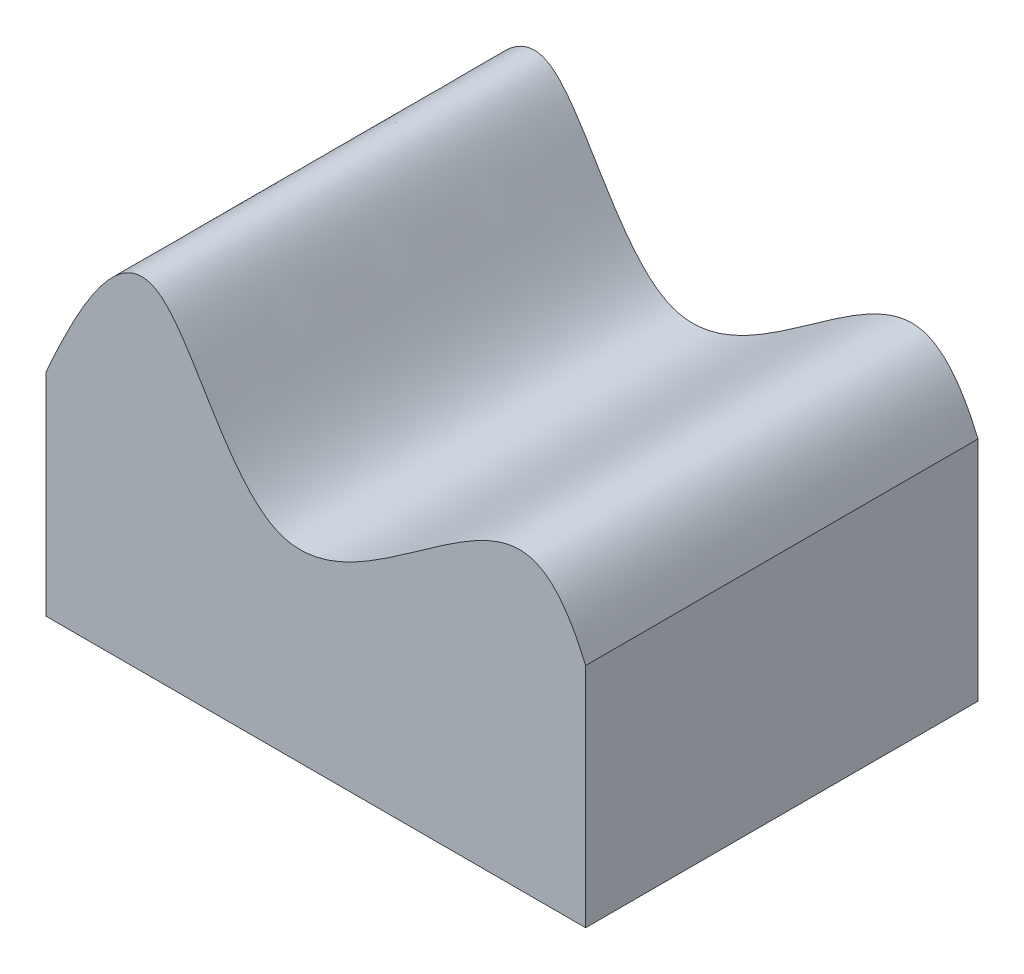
ISO-10303-21;
HEADER;
FILE_DESCRIPTION(('STEP AP214'),'2;1');
FILE_NAME('part.step','',(''),(''),'','','');
FILE_SCHEMA(('AUTOMOTIVE_DESIGN { 1 0 10303 214 1 1 1 1 }'));
ENDSEC;
DATA;
#1=APPLICATION_CONTEXT('core data for automotive mechanical design processes');
#2=APPLICATION_PROTOCOL_DEFINITION('international standard','automotive_design',2000,#1);
#3=PRODUCT_CONTEXT('',#1,'mechanical');
#4=PRODUCT('Part','Part','',(#3));
#5=PRODUCT_RELATED_PRODUCT_CATEGORY('part','',(#4));
#6=PRODUCT_DEFINITION_FORMATION('','',#4);
#7=PRODUCT_DEFINITION_CONTEXT('part definition',#1,'design');
#8=PRODUCT_DEFINITION('design','',#6,#7);
#9=PRODUCT_DEFINITION_SHAPE('','',#8);
#10=(LENGTH_UNIT() NAMED_UNIT(*) SI_UNIT(.MILLI.,.METRE.));
#11=(NAMED_UNIT(*) PLANE_ANGLE_UNIT() SI_UNIT($,.RADIAN.));
#12=(NAMED_UNIT(*) SI_UNIT($,.STERADIAN.) SOLID_ANGLE_UNIT());
#13=UNCERTAINTY_MEASURE_WITH_UNIT(LENGTH_MEASURE(1.E-05),#10,'distance_accuracy_value','');
#14=(GEOMETRIC_REPRESENTATION_CONTEXT(3) GLOBAL_UNCERTAINTY_ASSIGNED_CONTEXT((#13)) GLOBAL_UNIT_ASSIGNED_CONTEXT((#10,
#11,#12)) REPRESENTATION_CONTEXT('',''));
#15=CARTESIAN_POINT('',(0.,0.,0.));
#16=DIRECTION('',(0.,0.,1.));
#17=DIRECTION('',(1.,0.,0.));
#18=AXIS2_PLACEMENT_3D('',#15,#16,#17);
#19=CARTESIAN_POINT('',(-60.6854417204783,-29.9963508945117,44.1280693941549));
#20=DIRECTION('',(1.,0.,0.));
#21=DIRECTION('',(0.,0.,-1.));
#22=AXIS2_PLACEMENT_3D('',#19,#20,#21);
#23=PLANE('',#22);
#24=DIRECTION('',(0.,-1.,0.));
#25=VECTOR('',#24,1.);
#26=CARTESIAN_POINT('',(-60.6854417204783,-29.9963508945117,-44.1280693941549));
#27=LINE('',#26,#25);
#28=CARTESIAN_POINT('',(-60.6854417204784,17.5855673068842,-44.1280693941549));
#29=VERTEX_POINT('',#28);
#30=CARTESIAN_POINT('',(-60.6854417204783,-29.9963508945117,-44.1280693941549));
#31=VERTEX_POINT('',#30);
#32=EDGE_CURVE('E159',#29,#31,#27,.T.);
#33=ORIENTED_EDGE('',*,*,#32,.T.);
#34=DIRECTION('',(0.,0.,-1.));
#35=VECTOR('',#34,1.);
#36=CARTESIAN_POINT('',(-60.6854417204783,-29.9963508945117,44.1280693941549));
#37=LINE('',#36,#35);
#38=CARTESIAN_POINT('',(-60.6854417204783,-29.9963508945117,44.1280693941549));
#39=VERTEX_POINT('',#38);
#40=EDGE_CURVE('E44',#39,#31,#37,.T.);
#41=ORIENTED_EDGE('',*,*,#40,.F.);
#42=DIRECTION('',(0.,-1.,0.));
#43=VECTOR('',#42,1.);
#44=CARTESIAN_POINT('',(-60.6854417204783,-29.9963508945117,44.1280693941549));
#45=LINE('',#44,#43);
#46=CARTESIAN_POINT('',(-60.6854417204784,17.5855673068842,44.1280693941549));
#47=VERTEX_POINT('',#46);
#48=EDGE_CURVE('E153',#47,#39,#45,.T.);
#49=ORIENTED_EDGE('',*,*,#48,.F.);
#50=DIRECTION('',(0.,0.,1.));
#51=VECTOR('',#50,1.);
#52=CARTESIAN_POINT('',(-60.6854417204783,17.5855673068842,0.));
#53=LINE('',#52,#51);
#54=EDGE_CURVE('E106',#47,#29,#53,.F.);
#55=ORIENTED_EDGE('',*,*,#54,.T.);
#56=EDGE_LOOP('',(#33,#41,#49,#55));
#57=FACE_BOUND('',#56,.T.);
#58=ADVANCED_FACE('F100',(#57),#23,.F.);
#59=CARTESIAN_POINT('',(-60.6854417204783,-29.9963508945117,44.1280693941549));
#60=DIRECTION('',(0.,1.,0.));
#61=DIRECTION('',(0.,0.,1.));
#62=AXIS2_PLACEMENT_3D('',#59,#60,#61);
#63=PLANE('',#62);
#64=DIRECTION('',(1.,0.,0.));
#65=VECTOR('',#64,1.);
#66=CARTESIAN_POINT('',(-60.6854417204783,-29.9963508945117,-44.1280693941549));
#67=LINE('',#66,#65);
#68=CARTESIAN_POINT('',(60.6854417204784,-29.9963508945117,-44.1280693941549));
#69=VERTEX_POINT('',#68);
#70=EDGE_CURVE('E161',#31,#69,#67,.T.);
#71=ORIENTED_EDGE('',*,*,#70,.T.);
#72=DIRECTION('',(0.,0.,-1.));
#73=VECTOR('',#72,1.);
#74=CARTESIAN_POINT('',(60.6854417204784,-29.9963508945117,44.1280693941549));
#75=LINE('',#74,#73);
#76=CARTESIAN_POINT('',(60.6854417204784,-29.9963508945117,44.1280693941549));
#77=VERTEX_POINT('',#76);
#78=EDGE_CURVE('E112',#77,#69,#75,.T.);
#79=ORIENTED_EDGE('',*,*,#78,.F.);
#80=DIRECTION('',(1.,0.,0.));
#81=VECTOR('',#80,1.);
#82=CARTESIAN_POINT('',(-60.6854417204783,-29.9963508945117,44.1280693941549));
#83=LINE('',#82,#81);
#84=EDGE_CURVE('E140',#39,#77,#83,.T.);
#85=ORIENTED_EDGE('',*,*,#84,.F.);
#86=ORIENTED_EDGE('',*,*,#40,.T.);
#87=EDGE_LOOP('',(#71,#79,#85,#86));
#88=FACE_BOUND('',#87,.T.);
#89=ADVANCED_FACE('F188',(#88),#63,.F.);
#90=CARTESIAN_POINT('',(60.6854417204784,-29.9963508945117,44.1280693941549));
#91=DIRECTION('',(-1.,0.,0.));
#92=DIRECTION('',(0.,-1.,0.));
#93=AXIS2_PLACEMENT_3D('',#90,#91,#92);
#94=PLANE('',#93);
#95=DIRECTION('',(0.,1.,0.));
#96=VECTOR('',#95,1.);
#97=CARTESIAN_POINT('',(60.6854417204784,-29.9963508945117,-44.1280693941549));
#98=LINE('',#97,#96);
#99=CARTESIAN_POINT('',(60.6854417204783,21.0898986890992,-44.1280693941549));
#100=VERTEX_POINT('',#99);
#101=EDGE_CURVE('E154',#69,#100,#98,.T.);
#102=ORIENTED_EDGE('',*,*,#101,.T.);
#103=DIRECTION('',(0.,0.,1.));
#104=VECTOR('',#103,1.);
#105=CARTESIAN_POINT('',(60.6854417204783,21.0898986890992,0.));
#106=LINE('',#105,#104);
#107=CARTESIAN_POINT('',(60.6854417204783,21.0898986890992,44.1280693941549));
#108=VERTEX_POINT('',#107);
#109=EDGE_CURVE('E149',#108,#100,#106,.F.);
#110=ORIENTED_EDGE('',*,*,#109,.F.);
#111=DIRECTION('',(0.,1.,0.));
#112=VECTOR('',#111,1.);
#113=CARTESIAN_POINT('',(60.6854417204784,-29.9963508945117,44.1280693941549));
#114=LINE('',#113,#112);
#115=EDGE_CURVE('E165',#77,#108,#114,.T.);
#116=ORIENTED_EDGE('',*,*,#115,.F.);
#117=ORIENTED_EDGE('',*,*,#78,.T.);
#118=EDGE_LOOP('',(#102,#110,#116,#117));
#119=FACE_BOUND('',#118,.T.);
#120=ADVANCED_FACE('F185',(#119),#94,.F.);
#121=CARTESIAN_POINT('',(-69.1741102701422,-2.69924633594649,-70.5138398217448));
#122=CARTESIAN_POINT('',(-57.8502774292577,25.0636272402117,-70.5138398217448));
#123=CARTESIAN_POINT('',(-38.1766225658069,73.2979309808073,-70.5138398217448));
#124=CARTESIAN_POINT('',(-9.11600174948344,-16.2820314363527,-70.5138398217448));
#125=CARTESIAN_POINT('',(50.3210809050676,60.8549096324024,-70.5138398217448));
#126=CARTESIAN_POINT('',(63.1056676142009,16.022012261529,-70.5138398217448));
#127=CARTESIAN_POINT('',(68.6261598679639,-3.33721054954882,-70.5138398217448));
#128=B_SPLINE_CURVE_WITH_KNOTS('',3,(#121,#122,#123,#124,#125,#126,#127),.UNSPECIFIED.,.F.,.F.,
(4,1,1,1,4),(0.,0.28457012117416,0.494402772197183,0.781678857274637,1.),.UNSPECIFIED.);
#129=DIRECTION('',(0.,0.,1.));
#130=VECTOR('',#129,1.);
#131=SURFACE_OF_LINEAR_EXTRUSION('',#128,#130);
#132=CARTESIAN_POINT('',(60.6854417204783,21.0898986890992,-44.1280693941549));
#133=CARTESIAN_POINT('',(60.5244460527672,21.4695030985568,-44.1280693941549));
#134=CARTESIAN_POINT('',(60.3604852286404,21.8478678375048,-44.1280693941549));
#135=CARTESIAN_POINT('',(60.0254467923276,22.6026398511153,-44.1280693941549));
#136=CARTESIAN_POINT('',(59.8543513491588,22.9790392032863,-44.1280693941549));
#137=CARTESIAN_POINT('',(59.5044409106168,23.7289445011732,-44.1280693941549));
#138=CARTESIAN_POINT('',(59.3256144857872,24.1024451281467,-44.1280693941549));
#139=CARTESIAN_POINT('',(58.9595060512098,24.8455427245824,-44.1280693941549));
#140=CARTESIAN_POINT('',(58.7722194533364,25.2151374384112,-44.1280693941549));
#141=CARTESIAN_POINT('',(58.384620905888,25.9564427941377,-44.1280693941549));
#142=CARTESIAN_POINT('',(58.1841287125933,26.3280594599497,-44.1280693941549));
#143=CARTESIAN_POINT('',(57.7723297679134,27.0649642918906,-44.1280693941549));
#144=CARTESIAN_POINT('',(57.5610299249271,27.4302563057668,-44.1280693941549));
#145=CARTESIAN_POINT('',(57.1262681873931,28.1531784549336,-44.1280693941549));
#146=CARTESIAN_POINT('',(56.9028155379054,28.5108141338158,-44.1280693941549));
#147=CARTESIAN_POINT('',(56.4420851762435,29.2169355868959,-44.1280693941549));
#148=CARTESIAN_POINT('',(56.2048126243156,29.565424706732,-44.1280693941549));
#149=CARTESIAN_POINT('',(55.8068960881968,30.1220654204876,-44.1280693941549));
#150=CARTESIAN_POINT('',(55.651042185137,30.3336468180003,-44.1280693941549));
#151=CARTESIAN_POINT('',(55.3327411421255,30.751830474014,-44.1280693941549));
#152=CARTESIAN_POINT('',(55.1702935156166,30.9584323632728,-44.1280693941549));
#153=CARTESIAN_POINT('',(54.8382993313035,31.3659069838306,-44.1280693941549));
#154=CARTESIAN_POINT('',(54.6687518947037,31.566779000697,-44.1280693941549));
#155=CARTESIAN_POINT('',(54.3225433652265,31.9613274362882,-44.1280693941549));
#156=CARTESIAN_POINT('',(54.1459033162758,32.1550222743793,-44.1280693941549));
#157=CARTESIAN_POINT('',(53.7845729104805,32.5347537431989,-44.1280693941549));
#158=CARTESIAN_POINT('',(53.5998830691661,32.7207908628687,-44.1280693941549));
#159=CARTESIAN_POINT('',(53.2219939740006,33.0839832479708,-44.1280693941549));
#160=CARTESIAN_POINT('',(53.0287957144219,33.2611395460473,-44.1280693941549));
#161=CARTESIAN_POINT('',(52.5861191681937,33.6464011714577,-44.1280693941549));
#162=CARTESIAN_POINT('',(52.3342370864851,33.8517669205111,-44.1280693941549));
#163=CARTESIAN_POINT('',(51.8162511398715,34.2436900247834,-44.1280693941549));
#164=CARTESIAN_POINT('',(51.5501502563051,34.4302512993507,-44.1280693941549));
#165=CARTESIAN_POINT('',(51.0040042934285,34.7809841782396,-44.1280693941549));
#166=CARTESIAN_POINT('',(50.7239785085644,34.9451856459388,-44.1280693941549));
#167=CARTESIAN_POINT('',(50.1503541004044,35.2479314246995,-44.1280693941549));
#168=CARTESIAN_POINT('',(49.8567583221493,35.3864810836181,-44.1280693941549));
#169=CARTESIAN_POINT('',(49.3046750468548,35.6151282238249,-44.1280693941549));
#170=CARTESIAN_POINT('',(49.0479228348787,35.7094184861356,-44.1280693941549));
#171=CARTESIAN_POINT('',(48.5273513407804,35.8758539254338,-44.1280693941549));
#172=CARTESIAN_POINT('',(48.2635329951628,35.9480020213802,-44.1280693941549));
#173=CARTESIAN_POINT('',(47.7308143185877,36.0690689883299,-44.1280693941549));
#174=CARTESIAN_POINT('',(47.4619184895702,36.118007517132,-44.1280693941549));
#175=CARTESIAN_POINT('',(47.0562277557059,36.1738294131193,-44.1280693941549));
#176=CARTESIAN_POINT('',(46.9205884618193,36.1895066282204,-44.1280693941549));
#177=CARTESIAN_POINT('',(46.6487592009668,36.215022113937,-44.1280693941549));
#178=CARTESIAN_POINT('',(46.5125692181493,36.2248602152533,-44.1280693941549));
#179=CARTESIAN_POINT('',(46.0311081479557,36.2496060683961,-44.1280693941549));
#180=CARTESIAN_POINT('',(45.6849670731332,36.2492142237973,-44.1280693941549));
#181=CARTESIAN_POINT('',(44.9942102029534,36.2169202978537,-44.1280693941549));
#182=CARTESIAN_POINT('',(44.6495953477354,36.1850009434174,-44.1280693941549));
#183=CARTESIAN_POINT('',(43.9626485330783,36.0942300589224,-44.1280693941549));
#184=CARTESIAN_POINT('',(43.620330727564,36.0352739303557,-44.1280693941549));
#185=CARTESIAN_POINT('',(42.9405391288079,35.8947701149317,-44.1280693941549));
#186=CARTESIAN_POINT('',(42.6030643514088,35.813227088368,-44.1280693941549));
#187=CARTESIAN_POINT('',(41.8305153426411,35.60335962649,-44.1280693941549));
#188=CARTESIAN_POINT('',(41.3972662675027,35.4683580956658,-44.1280693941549));
#189=CARTESIAN_POINT('',(40.5392181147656,35.1727218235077,-44.1280693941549));
#190=CARTESIAN_POINT('',(40.114428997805,35.012058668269,-44.1280693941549));
#191=CARTESIAN_POINT('',(39.2726066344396,34.670116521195,-44.1280693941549));
#192=CARTESIAN_POINT('',(38.8555850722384,34.4888089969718,-44.1280693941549));
#193=CARTESIAN_POINT('',(38.029044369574,34.1097161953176,-44.1280693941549));
#194=CARTESIAN_POINT('',(37.6195268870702,33.9119273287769,-44.1280693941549));
#195=CARTESIAN_POINT('',(36.8049787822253,33.501867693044,-44.1280693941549));
#196=CARTESIAN_POINT('',(36.399985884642,33.289522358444,-44.1280693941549));
#197=CARTESIAN_POINT('',(35.5964319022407,32.8540601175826,-44.1280693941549));
#198=CARTESIAN_POINT('',(35.1978642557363,32.6309552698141,-44.1280693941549));
#199=CARTESIAN_POINT('',(34.406126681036,32.1758487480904,-44.1280693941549));
#200=CARTESIAN_POINT('',(34.0129541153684,31.9438516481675,-44.1280693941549));
#201=CARTESIAN_POINT('',(33.2311709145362,31.4725014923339,-44.1280693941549));
#202=CARTESIAN_POINT('',(32.8425593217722,31.2331500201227,-44.1280693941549));
#203=CARTESIAN_POINT('',(31.8796003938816,30.6295635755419,-44.1280693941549));
#204=CARTESIAN_POINT('',(31.307579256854,30.2616214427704,-44.1280693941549));
#205=CARTESIAN_POINT('',(30.1700515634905,29.5157823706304,-44.1280693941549));
#206=CARTESIAN_POINT('',(29.6045453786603,29.1378848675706,-44.1280693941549));
#207=CARTESIAN_POINT('',(28.478033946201,28.3747287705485,-44.1280693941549));
#208=CARTESIAN_POINT('',(27.9170316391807,27.9894658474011,-44.1280693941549));
#209=CARTESIAN_POINT('',(26.7983617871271,27.2141662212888,-44.1280693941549));
#210=CARTESIAN_POINT('',(26.2406941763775,26.8241296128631,-44.1280693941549));
#211=CARTESIAN_POINT('',(25.1269750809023,26.0410988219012,-44.1280693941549));
#212=CARTESIAN_POINT('',(24.5709246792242,25.6481031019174,-44.1280693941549));
#213=CARTESIAN_POINT('',(23.4594483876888,24.8612327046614,-44.1280693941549));
#214=CARTESIAN_POINT('',(22.9040224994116,24.4673580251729,-44.1280693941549));
#215=CARTESIAN_POINT('',(21.2426744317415,23.2911894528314,-44.1280693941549));
#216=CARTESIAN_POINT('',(20.1358263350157,22.5101779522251,-44.1280693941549));
#217=CARTESIAN_POINT('',(18.4667567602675,21.3519008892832,-44.1280693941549));
#218=CARTESIAN_POINT('',(17.9090778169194,20.9681117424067,-44.1280693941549));
#219=CARTESIAN_POINT('',(16.7894688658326,20.2067934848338,-44.1280693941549));
#220=CARTESIAN_POINT('',(16.2275389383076,19.8292642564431,-44.1280693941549));
#221=CARTESIAN_POINT('',(15.098356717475,19.082716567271,-44.1280693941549));
#222=CARTESIAN_POINT('',(14.5311066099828,18.7136948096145,-44.1280693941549));
#223=CARTESIAN_POINT('',(13.389736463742,17.9864556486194,-44.1280693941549));
#224=CARTESIAN_POINT('',(12.8156167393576,17.6282377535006,-44.1280693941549));
#225=CARTESIAN_POINT('',(11.6608604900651,16.9265757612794,-44.1280693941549));
#226=CARTESIAN_POINT('',(11.0802501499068,16.5830887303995,-44.1280693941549));
#227=CARTESIAN_POINT('',(9.90915324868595,15.9131280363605,-44.1280693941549));
#228=CARTESIAN_POINT('',(9.31866549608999,15.5866564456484,-44.1280693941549));
#229=CARTESIAN_POINT('',(8.12398895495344,14.9538800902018,-44.1280693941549));
#230=CARTESIAN_POINT('',(7.51975590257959,14.6476584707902,-44.1280693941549));
#231=CARTESIAN_POINT('',(6.29820199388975,14.0623264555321,-44.1280693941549));
#232=CARTESIAN_POINT('',(5.68088195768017,13.7832143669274,-44.1280693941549));
#233=CARTESIAN_POINT('',(4.63398030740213,13.3441524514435,-44.1280693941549));
#234=CARTESIAN_POINT('',(4.208313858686,13.1748762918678,-44.1280693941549));
#235=CARTESIAN_POINT('',(3.34999453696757,12.8548131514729,-44.1280693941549));
#236=CARTESIAN_POINT('',(2.91734109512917,12.7040276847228,-44.1280693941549));
#237=CARTESIAN_POINT('',(2.04473278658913,12.4241798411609,-44.1280693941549));
#238=CARTESIAN_POINT('',(1.60477385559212,12.2951300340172,-44.1280693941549));
#239=CARTESIAN_POINT('',(0.720138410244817,12.0633168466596,-44.1280693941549));
#240=CARTESIAN_POINT('',(0.275494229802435,11.9604315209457,-44.1280693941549));
#241=CARTESIAN_POINT('',(-0.619564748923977,11.7846419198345,-44.1280693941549));
#242=CARTESIAN_POINT('',(-1.06997684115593,11.7117240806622,-44.1280693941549));
#243=CARTESIAN_POINT('',(-1.97473196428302,11.6008149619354,-44.1280693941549));
#244=CARTESIAN_POINT('',(-2.42907016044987,11.5627855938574,-44.1280693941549));
#245=CARTESIAN_POINT('',(-3.26119582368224,11.5297528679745,-44.1280693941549));
#246=CARTESIAN_POINT('',(-3.63872797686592,11.5284812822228,-44.1280693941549));
#247=CARTESIAN_POINT('',(-4.39273398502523,11.5560443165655,-44.1280693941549));
#248=CARTESIAN_POINT('',(-4.7692079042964,11.5848770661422,-44.1280693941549));
#249=CARTESIAN_POINT('',(-5.51739961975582,11.6747846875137,-44.1280693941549));
#250=CARTESIAN_POINT('',(-5.88912734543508,11.7357742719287,-44.1280693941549));
#251=CARTESIAN_POINT('',(-6.44129673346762,11.852332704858,-44.1280693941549));
#252=CARTESIAN_POINT('',(-6.6244556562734,11.8953664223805,-44.1280693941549));
#253=CARTESIAN_POINT('',(-6.98860271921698,11.9898480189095,-44.1280693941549));
#254=CARTESIAN_POINT('',(-7.16959089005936,12.0412957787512,-44.1280693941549));
#255=CARTESIAN_POINT('',(-7.52907673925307,12.1526180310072,-44.1280693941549));
#256=CARTESIAN_POINT('',(-7.70757282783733,12.21249765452,-44.1280693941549));
#257=CARTESIAN_POINT('',(-8.06155269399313,12.3405757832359,-44.1280693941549));
#258=CARTESIAN_POINT('',(-8.23703646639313,12.4087743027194,-44.1280693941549));
#259=CARTESIAN_POINT('',(-8.58479668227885,12.5529647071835,-44.1280693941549));
#260=CARTESIAN_POINT('',(-8.75707264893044,12.6289577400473,-44.1280693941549));
#261=CARTESIAN_POINT('',(-9.09824883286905,12.7881517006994,-44.1280693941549));
#262=CARTESIAN_POINT('',(-9.26714898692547,12.8713527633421,-44.1280693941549));
#263=CARTESIAN_POINT('',(-9.7696736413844,13.1314561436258,-44.1280693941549));
#264=CARTESIAN_POINT('',(-10.098124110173,13.3184389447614,-44.1280693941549));
#265=CARTESIAN_POINT('',(-10.7410288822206,13.7148857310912,-44.1280693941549));
#266=CARTESIAN_POINT('',(-11.0554820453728,13.9243515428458,-44.1280693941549));
#267=CARTESIAN_POINT('',(-11.734408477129,14.4071677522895,-44.1280693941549));
#268=CARTESIAN_POINT('',(-12.0958379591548,14.6847884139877,-44.1280693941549));
#269=CARTESIAN_POINT('',(-12.8008922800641,15.2620818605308,-44.1280693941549));
#270=CARTESIAN_POINT('',(-13.1445043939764,15.5617700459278,-44.1280693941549));
#271=CARTESIAN_POINT('',(-13.8155688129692,16.1788553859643,-44.1280693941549));
#272=CARTESIAN_POINT('',(-14.1430155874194,16.4962585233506,-44.1280693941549));
#273=CARTESIAN_POINT('',(-14.7841498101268,17.1460497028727,-44.1280693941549));
#274=CARTESIAN_POINT('',(-15.0978036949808,17.4784706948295,-44.1280693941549));
#275=CARTESIAN_POINT('',(-15.7121090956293,18.1547857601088,-44.1280693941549));
#276=CARTESIAN_POINT('',(-16.0127666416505,18.4986743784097,-44.1280693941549));
#277=CARTESIAN_POINT('',(-16.6027521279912,19.1959115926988,-44.1280693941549));
#278=CARTESIAN_POINT('',(-16.8920818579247,19.5492586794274,-44.1280693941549));
#279=CARTESIAN_POINT('',(-17.4281844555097,20.2227209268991,-44.1280693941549));
#280=CARTESIAN_POINT('',(-17.6760265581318,20.5419879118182,-44.1280693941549));
#281=CARTESIAN_POINT('',(-18.16487091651,21.1857237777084,-44.1280693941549));
#282=CARTESIAN_POINT('',(-18.4058729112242,21.5101928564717,-44.1280693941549));
#283=CARTESIAN_POINT('',(-19.1200437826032,22.4904377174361,-44.1280693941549));
#284=CARTESIAN_POINT('',(-19.5841787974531,23.1527984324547,-44.1280693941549));
#285=CARTESIAN_POINT('',(-20.4943411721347,24.4903982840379,-44.1280693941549));
#286=CARTESIAN_POINT('',(-20.9403559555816,25.165645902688,-44.1280693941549));
#287=CARTESIAN_POINT('',(-21.818971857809,26.52493816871,-44.1280693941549));
#288=CARTESIAN_POINT('',(-22.2515707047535,27.2089842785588,-44.1280693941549));
#289=CARTESIAN_POINT('',(-23.1086601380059,28.5840936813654,-44.1280693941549));
#290=CARTESIAN_POINT('',(-23.533131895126,29.2751686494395,-44.1280693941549));
#291=CARTESIAN_POINT('',(-24.3771636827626,30.6598030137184,-44.1280693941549));
#292=CARTESIAN_POINT('',(-24.7967261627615,31.3533609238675,-44.1280693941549));
#293=CARTESIAN_POINT('',(-25.635462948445,32.7403574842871,-44.1280693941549));
#294=CARTESIAN_POINT('',(-26.0546373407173,33.4337960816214,-44.1280693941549));
#295=CARTESIAN_POINT('',(-26.6869141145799,34.4717121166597,-44.1280693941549));
#296=CARTESIAN_POINT('',(-26.8982351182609,34.8172720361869,-44.1280693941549));
#297=CARTESIAN_POINT('',(-27.3227799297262,35.5072199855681,-44.1280693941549));
#298=CARTESIAN_POINT('',(-27.536003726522,35.8516080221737,-44.1280693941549));
#299=CARTESIAN_POINT('',(-27.9650405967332,36.538541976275,-44.1280693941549));
#300=CARTESIAN_POINT('',(-28.1808523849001,36.8810886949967,-44.1280693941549));
#301=CARTESIAN_POINT('',(-28.6161089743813,37.5639612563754,-44.1280693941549));
#302=CARTESIAN_POINT('',(-28.8355544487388,37.9042866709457,-44.1280693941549));
#303=CARTESIAN_POINT('',(-29.2791923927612,38.5820562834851,-44.1280693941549));
#304=CARTESIAN_POINT('',(-29.5033869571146,38.9194991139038,-44.1280693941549));
#305=CARTESIAN_POINT('',(-29.9578811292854,39.5906852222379,-44.1280693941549));
#306=CARTESIAN_POINT('',(-30.1881858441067,39.9244250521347,-44.1280693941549));
#307=CARTESIAN_POINT('',(-30.6555282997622,40.5856355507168,-44.1280693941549));
#308=CARTESIAN_POINT('',(-30.8925430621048,40.9131223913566,-44.1280693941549));
#309=CARTESIAN_POINT('',(-31.3758215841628,41.5611180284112,-44.1280693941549));
#310=CARTESIAN_POINT('',(-31.6220833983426,41.8816282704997,-44.1280693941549));
#311=CARTESIAN_POINT('',(-32.1260303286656,42.5130512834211,-44.1280693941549));
#312=CARTESIAN_POINT('',(-32.3837024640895,42.8239743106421,-44.1280693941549));
#313=CARTESIAN_POINT('',(-32.7811552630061,43.2806250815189,-44.1280693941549));
#314=CARTESIAN_POINT('',(-32.9154112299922,43.4311650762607,-44.1280693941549));
#315=CARTESIAN_POINT('',(-33.1880803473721,43.7284268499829,-44.1280693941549));
#316=CARTESIAN_POINT('',(-33.3264932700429,43.8751488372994,-44.1280693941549));
#317=CARTESIAN_POINT('',(-33.6508477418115,44.2080103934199,-44.1280693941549));
#318=CARTESIAN_POINT('',(-33.8384340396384,44.3925566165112,-44.1280693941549));
#319=CARTESIAN_POINT('',(-34.2230005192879,44.7518147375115,-44.1280693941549));
#320=CARTESIAN_POINT('',(-34.4199834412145,44.9265237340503,-44.1280693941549));
#321=CARTESIAN_POINT('',(-34.7232959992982,45.1786207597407,-44.1280693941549));
#322=CARTESIAN_POINT('',(-34.8255745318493,45.2608958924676,-44.1280693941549));
#323=CARTESIAN_POINT('',(-35.0330200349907,45.4217211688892,-44.1280693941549));
#324=CARTESIAN_POINT('',(-35.138186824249,45.5002715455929,-44.1280693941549));
#325=CARTESIAN_POINT('',(-35.3515333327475,45.6530437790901,-44.1280693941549));
#326=CARTESIAN_POINT('',(-35.4597111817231,45.7272682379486,-44.1280693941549));
#327=CARTESIAN_POINT('',(-35.6793411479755,45.8707641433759,-44.1280693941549));
#328=CARTESIAN_POINT('',(-35.7907939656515,45.9400345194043,-44.1280693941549));
#329=CARTESIAN_POINT('',(-36.0588081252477,46.0976179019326,-44.1280693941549));
#330=CARTESIAN_POINT('',(-36.2168118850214,46.1835023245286,-44.1280693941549));
#331=CARTESIAN_POINT('',(-36.5387415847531,46.34334212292,-44.1280693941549));
#332=CARTESIAN_POINT('',(-36.7026667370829,46.4172990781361,-44.1280693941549));
#333=CARTESIAN_POINT('',(-37.0358687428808,46.5517179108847,-44.1280693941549));
#334=CARTESIAN_POINT('',(-37.2051419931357,46.6121886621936,-44.1280693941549));
#335=CARTESIAN_POINT('',(-37.5483014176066,46.7182762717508,-44.1280693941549));
#336=CARTESIAN_POINT('',(-37.7221874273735,46.7638936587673,-44.1280693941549));
#337=CARTESIAN_POINT('',(-38.0746889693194,46.8394227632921,-44.1280693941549));
#338=CARTESIAN_POINT('',(-38.2533297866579,46.8692172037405,-44.1280693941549));
#339=CARTESIAN_POINT('',(-38.612620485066,46.9119085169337,-44.1280693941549));
#340=CARTESIAN_POINT('',(-38.7932703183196,46.9248057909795,-44.1280693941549));
#341=CARTESIAN_POINT('',(-39.1550483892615,46.9336158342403,-44.1280693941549));
#342=CARTESIAN_POINT('',(-39.3361767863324,46.9295219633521,-44.1280693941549));
#343=CARTESIAN_POINT('',(-39.6972974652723,46.9048490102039,-44.1280693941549));
#344=CARTESIAN_POINT('',(-39.8772896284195,46.8842682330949,-44.1280693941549));
#345=CARTESIAN_POINT('',(-40.2575833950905,46.8240075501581,-44.1280693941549));
#346=CARTESIAN_POINT('',(-40.4575525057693,46.782229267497,-44.1280693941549));
#347=CARTESIAN_POINT('',(-40.8528771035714,46.6809368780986,-44.1280693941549));
#348=CARTESIAN_POINT('',(-41.0482318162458,46.6214198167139,-44.1280693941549));
#349=CARTESIAN_POINT('',(-41.6265309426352,46.4192822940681,-44.1280693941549));
#350=CARTESIAN_POINT('',(-42.0014119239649,46.2531283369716,-44.1280693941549));
#351=CARTESIAN_POINT('',(-42.5153026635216,45.9849239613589,-44.1280693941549));
#352=CARTESIAN_POINT('',(-42.6647994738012,45.9017222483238,-44.1280693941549));
#353=CARTESIAN_POINT('',(-42.9596110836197,45.7282064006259,-44.1280693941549));
#354=CARTESIAN_POINT('',(-43.1049267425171,45.6378937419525,-44.1280693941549));
#355=CARTESIAN_POINT('',(-43.5349657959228,45.3575165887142,-44.1280693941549));
#356=CARTESIAN_POINT('',(-43.8136042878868,45.158107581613,-44.1280693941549));
#357=CARTESIAN_POINT('',(-44.3567712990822,44.7396507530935,-44.1280693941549));
#358=CARTESIAN_POINT('',(-44.6212574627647,44.5205487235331,-44.1280693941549));
#359=CARTESIAN_POINT('',(-45.1369005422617,44.0674514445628,-44.1280693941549));
#360=CARTESIAN_POINT('',(-45.3880620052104,43.8334613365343,-44.1280693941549));
#361=CARTESIAN_POINT('',(-45.9425542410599,43.2912477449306,-44.1280693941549));
#362=CARTESIAN_POINT('',(-46.2424673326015,42.9795432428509,-44.1280693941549));
#363=CARTESIAN_POINT('',(-46.8267918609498,42.3415877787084,-44.1280693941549));
#364=CARTESIAN_POINT('',(-47.1111907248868,42.0153253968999,-44.1280693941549));
#365=CARTESIAN_POINT('',(-47.6669122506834,41.351142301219,-44.1280693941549));
#366=CARTESIAN_POINT('',(-47.9382165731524,41.0132063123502,-44.1280693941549));
#367=CARTESIAN_POINT('',(-48.4694660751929,40.3280534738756,-44.1280693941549));
#368=CARTESIAN_POINT('',(-48.7294004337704,39.9808282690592,-44.1280693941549));
#369=CARTESIAN_POINT('',(-49.2391705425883,39.2791085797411,-44.1280693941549));
#370=CARTESIAN_POINT('',(-49.4890071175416,38.924614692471,-44.1280693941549));
#371=CARTESIAN_POINT('',(-49.9818716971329,38.2067012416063,-44.1280693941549));
#372=CARTESIAN_POINT('',(-50.224828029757,37.8432326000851,-44.1280693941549));
#373=CARTESIAN_POINT('',(-50.702624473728,37.1115708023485,-44.1280693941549));
#374=CARTESIAN_POINT('',(-50.9374730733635,36.7433831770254,-44.1280693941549));
#375=CARTESIAN_POINT('',(-51.4000935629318,36.0029076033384,-44.1280693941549));
#376=CARTESIAN_POINT('',(-51.6278696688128,35.6306222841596,-44.1280693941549));
#377=CARTESIAN_POINT('',(-52.07719396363,34.8824601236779,-44.1280693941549));
#378=CARTESIAN_POINT('',(-52.2987438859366,34.5065843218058,-44.1280693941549));
#379=CARTESIAN_POINT('',(-52.7363196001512,33.7516623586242,-44.1280693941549));
#380=CARTESIAN_POINT('',(-52.9523456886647,33.3726163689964,-44.1280693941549));
#381=CARTESIAN_POINT('',(-53.4022377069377,32.5711424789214,-44.1280693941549));
#382=CARTESIAN_POINT('',(-53.6355468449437,32.1484022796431,-44.1280693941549));
#383=CARTESIAN_POINT('',(-54.0967885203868,31.2999091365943,-44.1280693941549));
#384=CARTESIAN_POINT('',(-54.3247201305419,30.874155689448,-44.1280693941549));
#385=CARTESIAN_POINT('',(-54.7757728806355,30.0199948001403,-44.1280693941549));
#386=CARTESIAN_POINT('',(-54.9988929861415,29.5915868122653,-44.1280693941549));
#387=CARTESIAN_POINT('',(-55.4408045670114,28.7324334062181,-44.1280693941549));
#388=CARTESIAN_POINT('',(-55.6595951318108,28.3016875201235,-44.1280693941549));
#389=CARTESIAN_POINT('',(-56.0932618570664,27.4381400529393,-44.1280693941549));
#390=CARTESIAN_POINT('',(-56.3081373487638,27.0053381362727,-44.1280693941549));
#391=CARTESIAN_POINT('',(-56.7343333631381,26.1379322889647,-44.1280693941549));
#392=CARTESIAN_POINT('',(-56.9456535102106,25.7033281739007,-44.1280693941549));
#393=CARTESIAN_POINT('',(-57.3593001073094,24.8444931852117,-44.1280693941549));
#394=CARTESIAN_POINT('',(-57.5617143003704,24.4203045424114,-44.1280693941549));
#395=CARTESIAN_POINT('',(-57.9637322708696,23.5706361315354,-44.1280693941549));
#396=CARTESIAN_POINT('',(-58.1633362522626,23.1451564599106,-44.1280693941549));
#397=CARTESIAN_POINT('',(-58.5599580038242,22.2930931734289,-44.1280693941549));
#398=CARTESIAN_POINT('',(-58.7569762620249,21.8665097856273,-44.1280693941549));
#399=CARTESIAN_POINT('',(-59.1486263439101,21.012414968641,-44.1280693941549));
#400=CARTESIAN_POINT('',(-59.3432589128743,20.5849038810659,-44.1280693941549));
#401=CARTESIAN_POINT('',(-59.7303178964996,19.7291208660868,-44.1280693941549));
#402=CARTESIAN_POINT('',(-59.922745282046,19.3008493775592,-44.1280693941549));
#403=CARTESIAN_POINT('',(-60.3055526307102,18.4437021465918,-44.1280693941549));
#404=CARTESIAN_POINT('',(-60.4959337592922,18.0148269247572,-44.1280693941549));
#405=CARTESIAN_POINT('',(-60.6854417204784,17.5855673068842,-44.1280693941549));
#406=B_SPLINE_CURVE_WITH_KNOTS('',3,(#132,#133,#134,#135,#136,#137,#138,#139,#140,#141,#142,
#143,#144,#145,#146,#147,#148,#149,#150,#151,#152,#153,#154,#155,#156,#157,#158,#159,#160,#161,
#162,#163,#164,#165,#166,#167,#168,#169,#170,#171,#172,#173,#174,#175,#176,#177,#178,#179,#180,
#181,#182,#183,#184,#185,#186,#187,#188,#189,#190,#191,#192,#193,#194,#195,#196,#197,#198,#199,
#200,#201,#202,#203,#204,#205,#206,#207,#208,#209,#210,#211,#212,#213,#214,#215,#216,#217,#218,
#219,#220,#221,#222,#223,#224,#225,#226,#227,#228,#229,#230,#231,#232,#233,#234,#235,#236,#237,
#238,#239,#240,#241,#242,#243,#244,#245,#246,#247,#248,#249,#250,#251,#252,#253,#254,#255,#256,
#257,#258,#259,#260,#261,#262,#263,#264,#265,#266,#267,#268,#269,#270,#271,#272,#273,#274,#275,
#276,#277,#278,#279,#280,#281,#282,#283,#284,#285,#286,#287,#288,#289,#290,#291,#292,#293,#294,
#295,#296,#297,#298,#299,#300,#301,#302,#303,#304,#305,#306,#307,#308,#309,#310,#311,#312,#313,
#314,#315,#316,#317,#318,#319,#320,#321,#322,#323,#324,#325,#326,#327,#328,#329,#330,#331,#332,
#333,#334,#335,#336,#337,#338,#339,#340,#341,#342,#343,#344,#345,#346,#347,#348,#349,#350,#351,
#352,#353,#354,#355,#356,#357,#358,#359,#360,#361,#362,#363,#364,#365,#366,#367,#368,#369,#370,
#371,#372,#373,#374,#375,#376,#377,#378,#379,#380,#381,#382,#383,#384,#385,#386,#387,#388,#389,
#390,#391,#392,#393,#394,#395,#396,#397,#398,#399,#400,#401,#402,#403,#404,#405),.UNSPECIFIED.,
.F.,.F.,(4,2,2,2,2,2,2,2,2,2,2,2,2,2,2,2,2,2,2,2,2,2,2,2,2,2,2,2,2,2,2,2,2,2,2,2,2,2,2,2,2,2,2,
2,2,2,2,2,2,2,2,2,2,2,2,2,2,2,2,2,2,2,2,2,2,2,2,2,2,2,2,2,2,2,2,2,2,2,2,2,2,2,2,2,2,2,2,2,2,2,2,
2,2,2,2,2,2,2,2,2,2,2,2,2,2,2,2,2,2,2,2,2,2,2,2,2,2,2,2,2,2,2,2,2,2,2,2,2,2,2,2,2,2,2,2,2,4),
(0.,1.23701320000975,2.47732883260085,3.71954543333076,4.96244399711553,6.22903614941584,
7.49482855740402,8.75967114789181,10.0240444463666,10.8122967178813,11.600607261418,
12.3890156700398,13.1752364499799,13.9614069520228,14.7474858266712,15.7216867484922,
16.6956841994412,17.6683677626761,18.6408483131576,19.4604716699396,20.2799869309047,
21.0988068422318,21.5083238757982,21.9178527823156,22.9543885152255,23.9914924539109,
25.0326429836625,26.0735788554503,27.4339065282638,28.7957510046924,30.1595010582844,
31.5235488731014,32.8951986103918,34.2653452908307,35.6347964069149,37.0039546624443,
39.0442184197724,41.0845979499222,43.1262160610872,45.1677938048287,47.2105176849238,
49.2532467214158,53.3171332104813,55.3480374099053,57.3789033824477,59.4089686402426,
61.4389413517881,63.462527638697,65.4863598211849,67.5180429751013,69.5495991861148,
70.9235190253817,72.2975512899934,73.6723754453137,75.040669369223,76.4083432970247,
77.7745223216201,78.906046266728,80.0374999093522,81.1659676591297,81.7302400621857,
82.2945044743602,82.8591137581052,83.4237240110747,83.9884175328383,84.5531216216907,
85.6857686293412,86.8185077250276,88.1846450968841,89.5517450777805,90.9193095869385,
92.2900360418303,93.6601195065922,95.029985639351,96.2424075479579,97.4548756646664,
99.880775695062,102.308331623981,104.736296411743,107.169334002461,109.601100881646,
112.031955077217,113.247110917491,114.46225974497,115.676828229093,116.891624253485,
118.106967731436,119.323361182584,120.535999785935,121.748384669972,122.959424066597,
123.564490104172,124.169523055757,124.958690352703,125.748089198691,126.141810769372,
126.53550767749,126.928965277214,127.322507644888,127.861553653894,128.400528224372,
128.939147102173,129.477746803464,130.020284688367,130.56280968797,131.105546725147,
131.648339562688,132.260252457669,132.872267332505,134.097194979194,134.610384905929,
135.123468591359,136.150235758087,137.179921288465,138.209253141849,139.506253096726,
140.804288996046,142.10409301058,143.405108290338,144.706017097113,146.017478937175,
147.327523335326,148.636771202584,149.945650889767,151.254460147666,152.70295961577,
154.151707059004,155.600762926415,157.050120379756,158.499723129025,159.949478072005,
161.359490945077,162.769400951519,164.179040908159,165.588228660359,166.99677010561,
168.404461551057),.UNSPECIFIED.);
#407=EDGE_CURVE('E145',#100,#29,#406,.T.);
#408=ORIENTED_EDGE('',*,*,#407,.T.);
#409=ORIENTED_EDGE('',*,*,#54,.F.);
#410=CARTESIAN_POINT('',(60.6854417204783,21.0898986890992,44.1280693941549));
#411=CARTESIAN_POINT('',(60.5244460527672,21.4695030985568,44.1280693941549));
#412=CARTESIAN_POINT('',(60.3604852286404,21.8478678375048,44.1280693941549));
#413=CARTESIAN_POINT('',(60.0254467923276,22.6026398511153,44.1280693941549));
#414=CARTESIAN_POINT('',(59.8543513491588,22.9790392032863,44.1280693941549));
#415=CARTESIAN_POINT('',(59.5044409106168,23.7289445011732,44.1280693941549));
#416=CARTESIAN_POINT('',(59.3256144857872,24.1024451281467,44.1280693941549));
#417=CARTESIAN_POINT('',(58.9595060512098,24.8455427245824,44.1280693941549));
#418=CARTESIAN_POINT('',(58.7722194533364,25.2151374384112,44.1280693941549));
#419=CARTESIAN_POINT('',(58.384620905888,25.9564427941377,44.1280693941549));
#420=CARTESIAN_POINT('',(58.1841287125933,26.3280594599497,44.1280693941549));
#421=CARTESIAN_POINT('',(57.7723297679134,27.0649642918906,44.1280693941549));
#422=CARTESIAN_POINT('',(57.5610299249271,27.4302563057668,44.1280693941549));
#423=CARTESIAN_POINT('',(57.1262681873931,28.1531784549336,44.1280693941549));
#424=CARTESIAN_POINT('',(56.9028155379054,28.5108141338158,44.1280693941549));
#425=CARTESIAN_POINT('',(56.4420851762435,29.2169355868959,44.1280693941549));
#426=CARTESIAN_POINT('',(56.2048126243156,29.565424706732,44.1280693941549));
#427=CARTESIAN_POINT('',(55.8068960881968,30.1220654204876,44.1280693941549));
#428=CARTESIAN_POINT('',(55.651042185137,30.3336468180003,44.1280693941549));
#429=CARTESIAN_POINT('',(55.3327411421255,30.751830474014,44.1280693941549));
#430=CARTESIAN_POINT('',(55.1702935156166,30.9584323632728,44.1280693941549));
#431=CARTESIAN_POINT('',(54.8382993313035,31.3659069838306,44.1280693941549));
#432=CARTESIAN_POINT('',(54.6687518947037,31.566779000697,44.1280693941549));
#433=CARTESIAN_POINT('',(54.3225433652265,31.9613274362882,44.1280693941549));
#434=CARTESIAN_POINT('',(54.1459033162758,32.1550222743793,44.1280693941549));
#435=CARTESIAN_POINT('',(53.7845729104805,32.5347537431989,44.1280693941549));
#436=CARTESIAN_POINT('',(53.5998830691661,32.7207908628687,44.1280693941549));
#437=CARTESIAN_POINT('',(53.2219939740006,33.0839832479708,44.1280693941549));
#438=CARTESIAN_POINT('',(53.0287957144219,33.2611395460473,44.1280693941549));
#439=CARTESIAN_POINT('',(52.5861191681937,33.6464011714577,44.1280693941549));
#440=CARTESIAN_POINT('',(52.3342370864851,33.8517669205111,44.1280693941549));
#441=CARTESIAN_POINT('',(51.8162511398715,34.2436900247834,44.1280693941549));
#442=CARTESIAN_POINT('',(51.5501502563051,34.4302512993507,44.1280693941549));
#443=CARTESIAN_POINT('',(51.0040042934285,34.7809841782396,44.1280693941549));
#444=CARTESIAN_POINT('',(50.7239785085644,34.9451856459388,44.1280693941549));
#445=CARTESIAN_POINT('',(50.1503541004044,35.2479314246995,44.1280693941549));
#446=CARTESIAN_POINT('',(49.8567583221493,35.3864810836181,44.1280693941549));
#447=CARTESIAN_POINT('',(49.3046750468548,35.6151282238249,44.1280693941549));
#448=CARTESIAN_POINT('',(49.0479228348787,35.7094184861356,44.1280693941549));
#449=CARTESIAN_POINT('',(48.5273513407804,35.8758539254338,44.1280693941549));
#450=CARTESIAN_POINT('',(48.2635329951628,35.9480020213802,44.1280693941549));
#451=CARTESIAN_POINT('',(47.7308143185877,36.0690689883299,44.1280693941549));
#452=CARTESIAN_POINT('',(47.4619184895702,36.118007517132,44.1280693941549));
#453=CARTESIAN_POINT('',(47.0562277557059,36.1738294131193,44.1280693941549));
#454=CARTESIAN_POINT('',(46.9205884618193,36.1895066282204,44.1280693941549));
#455=CARTESIAN_POINT('',(46.6487592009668,36.215022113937,44.1280693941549));
#456=CARTESIAN_POINT('',(46.5125692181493,36.2248602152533,44.1280693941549));
#457=CARTESIAN_POINT('',(46.0311081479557,36.2496060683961,44.1280693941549));
#458=CARTESIAN_POINT('',(45.6849670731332,36.2492142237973,44.1280693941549));
#459=CARTESIAN_POINT('',(44.9942102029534,36.2169202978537,44.1280693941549));
#460=CARTESIAN_POINT('',(44.6495953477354,36.1850009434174,44.1280693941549));
#461=CARTESIAN_POINT('',(43.9626485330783,36.0942300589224,44.1280693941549));
#462=CARTESIAN_POINT('',(43.620330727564,36.0352739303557,44.1280693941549));
#463=CARTESIAN_POINT('',(42.9405391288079,35.8947701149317,44.1280693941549));
#464=CARTESIAN_POINT('',(42.6030643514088,35.813227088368,44.1280693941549));
#465=CARTESIAN_POINT('',(41.8305153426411,35.60335962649,44.1280693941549));
#466=CARTESIAN_POINT('',(41.3972662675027,35.4683580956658,44.1280693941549));
#467=CARTESIAN_POINT('',(40.5392181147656,35.1727218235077,44.1280693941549));
#468=CARTESIAN_POINT('',(40.114428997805,35.012058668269,44.1280693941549));
#469=CARTESIAN_POINT('',(39.2726066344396,34.670116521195,44.1280693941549));
#470=CARTESIAN_POINT('',(38.8555850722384,34.4888089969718,44.1280693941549));
#471=CARTESIAN_POINT('',(38.029044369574,34.1097161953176,44.1280693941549));
#472=CARTESIAN_POINT('',(37.6195268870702,33.9119273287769,44.1280693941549));
#473=CARTESIAN_POINT('',(36.8049787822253,33.501867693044,44.1280693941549));
#474=CARTESIAN_POINT('',(36.399985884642,33.289522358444,44.1280693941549));
#475=CARTESIAN_POINT('',(35.5964319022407,32.8540601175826,44.1280693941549));
#476=CARTESIAN_POINT('',(35.1978642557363,32.6309552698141,44.1280693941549));
#477=CARTESIAN_POINT('',(34.406126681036,32.1758487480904,44.1280693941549));
#478=CARTESIAN_POINT('',(34.0129541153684,31.9438516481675,44.1280693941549));
#479=CARTESIAN_POINT('',(33.2311709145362,31.4725014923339,44.1280693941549));
#480=CARTESIAN_POINT('',(32.8425593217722,31.2331500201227,44.1280693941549));
#481=CARTESIAN_POINT('',(31.8796003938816,30.6295635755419,44.1280693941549));
#482=CARTESIAN_POINT('',(31.307579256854,30.2616214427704,44.1280693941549));
#483=CARTESIAN_POINT('',(30.1700515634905,29.5157823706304,44.1280693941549));
#484=CARTESIAN_POINT('',(29.6045453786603,29.1378848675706,44.1280693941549));
#485=CARTESIAN_POINT('',(28.478033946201,28.3747287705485,44.1280693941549));
#486=CARTESIAN_POINT('',(27.9170316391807,27.9894658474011,44.1280693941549));
#487=CARTESIAN_POINT('',(26.7983617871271,27.2141662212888,44.1280693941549));
#488=CARTESIAN_POINT('',(26.2406941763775,26.8241296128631,44.1280693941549));
#489=CARTESIAN_POINT('',(25.1269750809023,26.0410988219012,44.1280693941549));
#490=CARTESIAN_POINT('',(24.5709246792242,25.6481031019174,44.1280693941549));
#491=CARTESIAN_POINT('',(23.4594483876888,24.8612327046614,44.1280693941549));
#492=CARTESIAN_POINT('',(22.9040224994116,24.4673580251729,44.1280693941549));
#493=CARTESIAN_POINT('',(21.2426744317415,23.2911894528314,44.1280693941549));
#494=CARTESIAN_POINT('',(20.1358263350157,22.5101779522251,44.1280693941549));
#495=CARTESIAN_POINT('',(18.4667567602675,21.3519008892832,44.1280693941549));
#496=CARTESIAN_POINT('',(17.9090778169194,20.9681117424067,44.1280693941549));
#497=CARTESIAN_POINT('',(16.7894688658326,20.2067934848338,44.1280693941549));
#498=CARTESIAN_POINT('',(16.2275389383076,19.8292642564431,44.1280693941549));
#499=CARTESIAN_POINT('',(15.098356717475,19.082716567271,44.1280693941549));
#500=CARTESIAN_POINT('',(14.5311066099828,18.7136948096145,44.1280693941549));
#501=CARTESIAN_POINT('',(13.389736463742,17.9864556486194,44.1280693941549));
#502=CARTESIAN_POINT('',(12.8156167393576,17.6282377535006,44.1280693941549));
#503=CARTESIAN_POINT('',(11.6608604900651,16.9265757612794,44.1280693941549));
#504=CARTESIAN_POINT('',(11.0802501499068,16.5830887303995,44.1280693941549));
#505=CARTESIAN_POINT('',(9.90915324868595,15.9131280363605,44.1280693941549));
#506=CARTESIAN_POINT('',(9.31866549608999,15.5866564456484,44.1280693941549));
#507=CARTESIAN_POINT('',(8.12398895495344,14.9538800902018,44.1280693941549));
#508=CARTESIAN_POINT('',(7.51975590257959,14.6476584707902,44.1280693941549));
#509=CARTESIAN_POINT('',(6.29820199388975,14.0623264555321,44.1280693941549));
#510=CARTESIAN_POINT('',(5.68088195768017,13.7832143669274,44.1280693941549));
#511=CARTESIAN_POINT('',(4.63398030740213,13.3441524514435,44.1280693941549));
#512=CARTESIAN_POINT('',(4.208313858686,13.1748762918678,44.1280693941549));
#513=CARTESIAN_POINT('',(3.34999453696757,12.8548131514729,44.1280693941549));
#514=CARTESIAN_POINT('',(2.91734109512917,12.7040276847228,44.1280693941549));
#515=CARTESIAN_POINT('',(2.04473278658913,12.4241798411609,44.1280693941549));
#516=CARTESIAN_POINT('',(1.60477385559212,12.2951300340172,44.1280693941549));
#517=CARTESIAN_POINT('',(0.720138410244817,12.0633168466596,44.1280693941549));
#518=CARTESIAN_POINT('',(0.275494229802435,11.9604315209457,44.1280693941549));
#519=CARTESIAN_POINT('',(-0.619564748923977,11.7846419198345,44.1280693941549));
#520=CARTESIAN_POINT('',(-1.06997684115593,11.7117240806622,44.1280693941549));
#521=CARTESIAN_POINT('',(-1.97473196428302,11.6008149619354,44.1280693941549));
#522=CARTESIAN_POINT('',(-2.42907016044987,11.5627855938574,44.1280693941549));
#523=CARTESIAN_POINT('',(-3.26119582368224,11.5297528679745,44.1280693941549));
#524=CARTESIAN_POINT('',(-3.63872797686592,11.5284812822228,44.1280693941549));
#525=CARTESIAN_POINT('',(-4.39273398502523,11.5560443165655,44.1280693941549));
#526=CARTESIAN_POINT('',(-4.7692079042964,11.5848770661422,44.1280693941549));
#527=CARTESIAN_POINT('',(-5.51739961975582,11.6747846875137,44.1280693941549));
#528=CARTESIAN_POINT('',(-5.88912734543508,11.7357742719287,44.1280693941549));
#529=CARTESIAN_POINT('',(-6.44129673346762,11.852332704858,44.1280693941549));
#530=CARTESIAN_POINT('',(-6.6244556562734,11.8953664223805,44.1280693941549));
#531=CARTESIAN_POINT('',(-6.98860271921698,11.9898480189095,44.1280693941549));
#532=CARTESIAN_POINT('',(-7.16959089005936,12.0412957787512,44.1280693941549));
#533=CARTESIAN_POINT('',(-7.52907673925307,12.1526180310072,44.1280693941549));
#534=CARTESIAN_POINT('',(-7.70757282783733,12.21249765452,44.1280693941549));
#535=CARTESIAN_POINT('',(-8.06155269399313,12.3405757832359,44.1280693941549));
#536=CARTESIAN_POINT('',(-8.23703646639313,12.4087743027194,44.1280693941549));
#537=CARTESIAN_POINT('',(-8.58479668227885,12.5529647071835,44.1280693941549));
#538=CARTESIAN_POINT('',(-8.75707264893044,12.6289577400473,44.1280693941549));
#539=CARTESIAN_POINT('',(-9.09824883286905,12.7881517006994,44.1280693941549));
#540=CARTESIAN_POINT('',(-9.26714898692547,12.8713527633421,44.1280693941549));
#541=CARTESIAN_POINT('',(-9.7696736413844,13.1314561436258,44.1280693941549));
#542=CARTESIAN_POINT('',(-10.098124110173,13.3184389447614,44.1280693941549));
#543=CARTESIAN_POINT('',(-10.7410288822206,13.7148857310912,44.1280693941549));
#544=CARTESIAN_POINT('',(-11.0554820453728,13.9243515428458,44.1280693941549));
#545=CARTESIAN_POINT('',(-11.734408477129,14.4071677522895,44.1280693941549));
#546=CARTESIAN_POINT('',(-12.0958379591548,14.6847884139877,44.1280693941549));
#547=CARTESIAN_POINT('',(-12.8008922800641,15.2620818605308,44.1280693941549));
#548=CARTESIAN_POINT('',(-13.1445043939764,15.5617700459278,44.1280693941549));
#549=CARTESIAN_POINT('',(-13.8155688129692,16.1788553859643,44.1280693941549));
#550=CARTESIAN_POINT('',(-14.1430155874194,16.4962585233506,44.1280693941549));
#551=CARTESIAN_POINT('',(-14.7841498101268,17.1460497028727,44.1280693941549));
#552=CARTESIAN_POINT('',(-15.0978036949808,17.4784706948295,44.1280693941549));
#553=CARTESIAN_POINT('',(-15.7121090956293,18.1547857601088,44.1280693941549));
#554=CARTESIAN_POINT('',(-16.0127666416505,18.4986743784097,44.1280693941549));
#555=CARTESIAN_POINT('',(-16.6027521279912,19.1959115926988,44.1280693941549));
#556=CARTESIAN_POINT('',(-16.8920818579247,19.5492586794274,44.1280693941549));
#557=CARTESIAN_POINT('',(-17.4281844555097,20.2227209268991,44.1280693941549));
#558=CARTESIAN_POINT('',(-17.6760265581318,20.5419879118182,44.1280693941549));
#559=CARTESIAN_POINT('',(-18.16487091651,21.1857237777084,44.1280693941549));
#560=CARTESIAN_POINT('',(-18.4058729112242,21.5101928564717,44.1280693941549));
#561=CARTESIAN_POINT('',(-19.1200437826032,22.4904377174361,44.1280693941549));
#562=CARTESIAN_POINT('',(-19.5841787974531,23.1527984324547,44.1280693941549));
#563=CARTESIAN_POINT('',(-20.4943411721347,24.4903982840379,44.1280693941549));
#564=CARTESIAN_POINT('',(-20.9403559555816,25.165645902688,44.1280693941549));
#565=CARTESIAN_POINT('',(-21.818971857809,26.52493816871,44.1280693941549));
#566=CARTESIAN_POINT('',(-22.2515707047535,27.2089842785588,44.1280693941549));
#567=CARTESIAN_POINT('',(-23.1086601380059,28.5840936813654,44.1280693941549));
#568=CARTESIAN_POINT('',(-23.533131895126,29.2751686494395,44.1280693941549));
#569=CARTESIAN_POINT('',(-24.3771636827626,30.6598030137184,44.1280693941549));
#570=CARTESIAN_POINT('',(-24.7967261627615,31.3533609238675,44.1280693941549));
#571=CARTESIAN_POINT('',(-25.635462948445,32.7403574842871,44.1280693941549));
#572=CARTESIAN_POINT('',(-26.0546373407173,33.4337960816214,44.1280693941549));
#573=CARTESIAN_POINT('',(-26.6869141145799,34.4717121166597,44.1280693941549));
#574=CARTESIAN_POINT('',(-26.8982351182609,34.8172720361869,44.1280693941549));
#575=CARTESIAN_POINT('',(-27.3227799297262,35.5072199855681,44.1280693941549));
#576=CARTESIAN_POINT('',(-27.536003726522,35.8516080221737,44.1280693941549));
#577=CARTESIAN_POINT('',(-27.9650405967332,36.538541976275,44.1280693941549));
#578=CARTESIAN_POINT('',(-28.1808523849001,36.8810886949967,44.1280693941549));
#579=CARTESIAN_POINT('',(-28.6161089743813,37.5639612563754,44.1280693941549));
#580=CARTESIAN_POINT('',(-28.8355544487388,37.9042866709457,44.1280693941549));
#581=CARTESIAN_POINT('',(-29.2791923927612,38.5820562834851,44.1280693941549));
#582=CARTESIAN_POINT('',(-29.5033869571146,38.9194991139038,44.1280693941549));
#583=CARTESIAN_POINT('',(-29.9578811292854,39.5906852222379,44.1280693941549));
#584=CARTESIAN_POINT('',(-30.1881858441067,39.9244250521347,44.1280693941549));
#585=CARTESIAN_POINT('',(-30.6555282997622,40.5856355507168,44.1280693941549));
#586=CARTESIAN_POINT('',(-30.8925430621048,40.9131223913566,44.1280693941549));
#587=CARTESIAN_POINT('',(-31.3758215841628,41.5611180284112,44.1280693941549));
#588=CARTESIAN_POINT('',(-31.6220833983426,41.8816282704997,44.1280693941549));
#589=CARTESIAN_POINT('',(-32.1260303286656,42.5130512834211,44.1280693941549));
#590=CARTESIAN_POINT('',(-32.3837024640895,42.8239743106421,44.1280693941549));
#591=CARTESIAN_POINT('',(-32.7811552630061,43.2806250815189,44.1280693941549));
#592=CARTESIAN_POINT('',(-32.9154112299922,43.4311650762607,44.1280693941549));
#593=CARTESIAN_POINT('',(-33.1880803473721,43.7284268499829,44.1280693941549));
#594=CARTESIAN_POINT('',(-33.3264932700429,43.8751488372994,44.1280693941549));
#595=CARTESIAN_POINT('',(-33.6508477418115,44.2080103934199,44.1280693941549));
#596=CARTESIAN_POINT('',(-33.8384340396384,44.3925566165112,44.1280693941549));
#597=CARTESIAN_POINT('',(-34.2230005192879,44.7518147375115,44.1280693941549));
#598=CARTESIAN_POINT('',(-34.4199834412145,44.9265237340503,44.1280693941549));
#599=CARTESIAN_POINT('',(-34.7232959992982,45.1786207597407,44.1280693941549));
#600=CARTESIAN_POINT('',(-34.8255745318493,45.2608958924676,44.1280693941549));
#601=CARTESIAN_POINT('',(-35.0330200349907,45.4217211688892,44.1280693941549));
#602=CARTESIAN_POINT('',(-35.138186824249,45.5002715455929,44.1280693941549));
#603=CARTESIAN_POINT('',(-35.3515333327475,45.6530437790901,44.1280693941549));
#604=CARTESIAN_POINT('',(-35.4597111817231,45.7272682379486,44.1280693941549));
#605=CARTESIAN_POINT('',(-35.6793411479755,45.8707641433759,44.1280693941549));
#606=CARTESIAN_POINT('',(-35.7907939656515,45.9400345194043,44.1280693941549));
#607=CARTESIAN_POINT('',(-36.0588081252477,46.0976179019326,44.1280693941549));
#608=CARTESIAN_POINT('',(-36.2168118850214,46.1835023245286,44.1280693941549));
#609=CARTESIAN_POINT('',(-36.5387415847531,46.34334212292,44.1280693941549));
#610=CARTESIAN_POINT('',(-36.7026667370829,46.4172990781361,44.1280693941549));
#611=CARTESIAN_POINT('',(-37.0358687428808,46.5517179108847,44.1280693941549));
#612=CARTESIAN_POINT('',(-37.2051419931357,46.6121886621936,44.1280693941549));
#613=CARTESIAN_POINT('',(-37.5483014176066,46.7182762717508,44.1280693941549));
#614=CARTESIAN_POINT('',(-37.7221874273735,46.7638936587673,44.1280693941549));
#615=CARTESIAN_POINT('',(-38.0746889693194,46.8394227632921,44.1280693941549));
#616=CARTESIAN_POINT('',(-38.2533297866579,46.8692172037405,44.1280693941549));
#617=CARTESIAN_POINT('',(-38.612620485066,46.9119085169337,44.1280693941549));
#618=CARTESIAN_POINT('',(-38.7932703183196,46.9248057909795,44.1280693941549));
#619=CARTESIAN_POINT('',(-39.1550483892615,46.9336158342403,44.1280693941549));
#620=CARTESIAN_POINT('',(-39.3361767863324,46.9295219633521,44.1280693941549));
#621=CARTESIAN_POINT('',(-39.6972974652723,46.9048490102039,44.1280693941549));
#622=CARTESIAN_POINT('',(-39.8772896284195,46.8842682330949,44.1280693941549));
#623=CARTESIAN_POINT('',(-40.2575833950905,46.8240075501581,44.1280693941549));
#624=CARTESIAN_POINT('',(-40.4575525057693,46.782229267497,44.1280693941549));
#625=CARTESIAN_POINT('',(-40.8528771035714,46.6809368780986,44.1280693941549));
#626=CARTESIAN_POINT('',(-41.0482318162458,46.6214198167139,44.1280693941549));
#627=CARTESIAN_POINT('',(-41.6265309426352,46.4192822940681,44.1280693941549));
#628=CARTESIAN_POINT('',(-42.0014119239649,46.2531283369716,44.1280693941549));
#629=CARTESIAN_POINT('',(-42.5153026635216,45.9849239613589,44.1280693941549));
#630=CARTESIAN_POINT('',(-42.6647994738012,45.9017222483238,44.1280693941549));
#631=CARTESIAN_POINT('',(-42.9596110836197,45.7282064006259,44.1280693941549));
#632=CARTESIAN_POINT('',(-43.1049267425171,45.6378937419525,44.1280693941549));
#633=CARTESIAN_POINT('',(-43.5349657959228,45.3575165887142,44.1280693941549));
#634=CARTESIAN_POINT('',(-43.8136042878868,45.158107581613,44.1280693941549));
#635=CARTESIAN_POINT('',(-44.3567712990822,44.7396507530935,44.1280693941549));
#636=CARTESIAN_POINT('',(-44.6212574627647,44.5205487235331,44.1280693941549));
#637=CARTESIAN_POINT('',(-45.1369005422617,44.0674514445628,44.1280693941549));
#638=CARTESIAN_POINT('',(-45.3880620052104,43.8334613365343,44.1280693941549));
#639=CARTESIAN_POINT('',(-45.9425542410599,43.2912477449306,44.1280693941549));
#640=CARTESIAN_POINT('',(-46.2424673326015,42.9795432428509,44.1280693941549));
#641=CARTESIAN_POINT('',(-46.8267918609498,42.3415877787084,44.1280693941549));
#642=CARTESIAN_POINT('',(-47.1111907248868,42.0153253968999,44.1280693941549));
#643=CARTESIAN_POINT('',(-47.6669122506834,41.351142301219,44.1280693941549));
#644=CARTESIAN_POINT('',(-47.9382165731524,41.0132063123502,44.1280693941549));
#645=CARTESIAN_POINT('',(-48.4694660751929,40.3280534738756,44.1280693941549));
#646=CARTESIAN_POINT('',(-48.7294004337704,39.9808282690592,44.1280693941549));
#647=CARTESIAN_POINT('',(-49.2391705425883,39.2791085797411,44.1280693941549));
#648=CARTESIAN_POINT('',(-49.4890071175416,38.924614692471,44.1280693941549));
#649=CARTESIAN_POINT('',(-49.9818716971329,38.2067012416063,44.1280693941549));
#650=CARTESIAN_POINT('',(-50.224828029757,37.8432326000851,44.1280693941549));
#651=CARTESIAN_POINT('',(-50.702624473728,37.1115708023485,44.1280693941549));
#652=CARTESIAN_POINT('',(-50.9374730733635,36.7433831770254,44.1280693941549));
#653=CARTESIAN_POINT('',(-51.4000935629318,36.0029076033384,44.1280693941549));
#654=CARTESIAN_POINT('',(-51.6278696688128,35.6306222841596,44.1280693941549));
#655=CARTESIAN_POINT('',(-52.07719396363,34.8824601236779,44.1280693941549));
#656=CARTESIAN_POINT('',(-52.2987438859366,34.5065843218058,44.1280693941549));
#657=CARTESIAN_POINT('',(-52.7363196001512,33.7516623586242,44.1280693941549));
#658=CARTESIAN_POINT('',(-52.9523456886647,33.3726163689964,44.1280693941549));
#659=CARTESIAN_POINT('',(-53.4022377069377,32.5711424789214,44.1280693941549));
#660=CARTESIAN_POINT('',(-53.6355468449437,32.1484022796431,44.1280693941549));
#661=CARTESIAN_POINT('',(-54.0967885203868,31.2999091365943,44.1280693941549));
#662=CARTESIAN_POINT('',(-54.3247201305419,30.874155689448,44.1280693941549));
#663=CARTESIAN_POINT('',(-54.7757728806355,30.0199948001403,44.1280693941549));
#664=CARTESIAN_POINT('',(-54.9988929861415,29.5915868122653,44.1280693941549));
#665=CARTESIAN_POINT('',(-55.4408045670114,28.7324334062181,44.1280693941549));
#666=CARTESIAN_POINT('',(-55.6595951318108,28.3016875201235,44.1280693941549));
#667=CARTESIAN_POINT('',(-56.0932618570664,27.4381400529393,44.1280693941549));
#668=CARTESIAN_POINT('',(-56.3081373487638,27.0053381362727,44.1280693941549));
#669=CARTESIAN_POINT('',(-56.7343333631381,26.1379322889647,44.1280693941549));
#670=CARTESIAN_POINT('',(-56.9456535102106,25.7033281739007,44.1280693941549));
#671=CARTESIAN_POINT('',(-57.3593001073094,24.8444931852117,44.1280693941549));
#672=CARTESIAN_POINT('',(-57.5617143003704,24.4203045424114,44.1280693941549));
#673=CARTESIAN_POINT('',(-57.9637322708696,23.5706361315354,44.1280693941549));
#674=CARTESIAN_POINT('',(-58.1633362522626,23.1451564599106,44.1280693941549));
#675=CARTESIAN_POINT('',(-58.5599580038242,22.2930931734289,44.1280693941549));
#676=CARTESIAN_POINT('',(-58.7569762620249,21.8665097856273,44.1280693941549));
#677=CARTESIAN_POINT('',(-59.1486263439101,21.012414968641,44.1280693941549));
#678=CARTESIAN_POINT('',(-59.3432589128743,20.5849038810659,44.1280693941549));
#679=CARTESIAN_POINT('',(-59.7303178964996,19.7291208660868,44.1280693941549));
#680=CARTESIAN_POINT('',(-59.922745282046,19.3008493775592,44.1280693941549));
#681=CARTESIAN_POINT('',(-60.3055526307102,18.4437021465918,44.1280693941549));
#682=CARTESIAN_POINT('',(-60.4959337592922,18.0148269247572,44.1280693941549));
#683=CARTESIAN_POINT('',(-60.6854417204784,17.5855673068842,44.1280693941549));
#684=B_SPLINE_CURVE_WITH_KNOTS('',3,(#410,#411,#412,#413,#414,#415,#416,#417,#418,#419,#420,
#421,#422,#423,#424,#425,#426,#427,#428,#429,#430,#431,#432,#433,#434,#435,#436,#437,#438,#439,
#440,#441,#442,#443,#444,#445,#446,#447,#448,#449,#450,#451,#452,#453,#454,#455,#456,#457,#458,
#459,#460,#461,#462,#463,#464,#465,#466,#467,#468,#469,#470,#471,#472,#473,#474,#475,#476,#477,
#478,#479,#480,#481,#482,#483,#484,#485,#486,#487,#488,#489,#490,#491,#492,#493,#494,#495,#496,
#497,#498,#499,#500,#501,#502,#503,#504,#505,#506,#507,#508,#509,#510,#511,#512,#513,#514,#515,
#516,#517,#518,#519,#520,#521,#522,#523,#524,#525,#526,#527,#528,#529,#530,#531,#532,#533,#534,
#535,#536,#537,#538,#539,#540,#541,#542,#543,#544,#545,#546,#547,#548,#549,#550,#551,#552,#553,
#554,#555,#556,#557,#558,#559,#560,#561,#562,#563,#564,#565,#566,#567,#568,#569,#570,#571,#572,
#573,#574,#575,#576,#577,#578,#579,#580,#581,#582,#583,#584,#585,#586,#587,#588,#589,#590,#591,
#592,#593,#594,#595,#596,#597,#598,#599,#600,#601,#602,#603,#604,#605,#606,#607,#608,#609,#610,
#611,#612,#613,#614,#615,#616,#617,#618,#619,#620,#621,#622,#623,#624,#625,#626,#627,#628,#629,
#630,#631,#632,#633,#634,#635,#636,#637,#638,#639,#640,#641,#642,#643,#644,#645,#646,#647,#648,
#649,#650,#651,#652,#653,#654,#655,#656,#657,#658,#659,#660,#661,#662,#663,#664,#665,#666,#667,
#668,#669,#670,#671,#672,#673,#674,#675,#676,#677,#678,#679,#680,#681,#682,#683),.UNSPECIFIED.,
.F.,.F.,(4,2,2,2,2,2,2,2,2,2,2,2,2,2,2,2,2,2,2,2,2,2,2,2,2,2,2,2,2,2,2,2,2,2,2,2,2,2,2,2,2,2,2,
2,2,2,2,2,2,2,2,2,2,2,2,2,2,2,2,2,2,2,2,2,2,2,2,2,2,2,2,2,2,2,2,2,2,2,2,2,2,2,2,2,2,2,2,2,2,2,2,
2,2,2,2,2,2,2,2,2,2,2,2,2,2,2,2,2,2,2,2,2,2,2,2,2,2,2,2,2,2,2,2,2,2,2,2,2,2,2,2,2,2,2,2,2,4),
(0.,1.23701320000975,2.47732883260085,3.71954543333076,4.96244399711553,6.22903614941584,
7.49482855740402,8.75967114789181,10.0240444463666,10.8122967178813,11.600607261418,
12.3890156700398,13.1752364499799,13.9614069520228,14.7474858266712,15.7216867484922,
16.6956841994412,17.6683677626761,18.6408483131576,19.4604716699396,20.2799869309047,
21.0988068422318,21.5083238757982,21.9178527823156,22.9543885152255,23.9914924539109,
25.0326429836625,26.0735788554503,27.4339065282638,28.7957510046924,30.1595010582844,
31.5235488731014,32.8951986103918,34.2653452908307,35.6347964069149,37.0039546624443,
39.0442184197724,41.0845979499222,43.1262160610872,45.1677938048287,47.2105176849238,
49.2532467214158,53.3171332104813,55.3480374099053,57.3789033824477,59.4089686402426,
61.4389413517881,63.462527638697,65.4863598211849,67.5180429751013,69.5495991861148,
70.9235190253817,72.2975512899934,73.6723754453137,75.040669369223,76.4083432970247,
77.7745223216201,78.906046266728,80.0374999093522,81.1659676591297,81.7302400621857,
82.2945044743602,82.8591137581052,83.4237240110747,83.9884175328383,84.5531216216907,
85.6857686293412,86.8185077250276,88.1846450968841,89.5517450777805,90.9193095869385,
92.2900360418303,93.6601195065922,95.029985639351,96.2424075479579,97.4548756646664,
99.880775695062,102.308331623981,104.736296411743,107.169334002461,109.601100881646,
112.031955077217,113.247110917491,114.46225974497,115.676828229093,116.891624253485,
118.106967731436,119.323361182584,120.535999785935,121.748384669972,122.959424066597,
123.564490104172,124.169523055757,124.958690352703,125.748089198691,126.141810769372,
126.53550767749,126.928965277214,127.322507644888,127.861553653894,128.400528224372,
128.939147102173,129.477746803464,130.020284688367,130.56280968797,131.105546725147,
131.648339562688,132.260252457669,132.872267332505,134.097194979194,134.610384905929,
135.123468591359,136.150235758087,137.179921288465,138.209253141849,139.506253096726,
140.804288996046,142.10409301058,143.405108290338,144.706017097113,146.017478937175,
147.327523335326,148.636771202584,149.945650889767,151.254460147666,152.70295961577,
154.151707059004,155.600762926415,157.050120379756,158.499723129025,159.949478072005,
161.359490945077,162.769400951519,164.179040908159,165.588228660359,166.99677010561,
168.404461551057),.UNSPECIFIED.);
#685=EDGE_CURVE('E120',#108,#47,#684,.T.);
#686=ORIENTED_EDGE('',*,*,#685,.F.);
#687=ORIENTED_EDGE('',*,*,#109,.T.);
#688=EDGE_LOOP('',(#408,#409,#686,#687));
#689=FACE_BOUND('',#688,.T.);
#690=ADVANCED_FACE('F102',(#689),#131,.F.);
#691=CARTESIAN_POINT('',(-60.6854417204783,29.9963508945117,44.1280693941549));
#692=DIRECTION('',(0.,0.,-1.));
#693=DIRECTION('',(-1.,0.,0.));
#694=AXIS2_PLACEMENT_3D('',#691,#692,#693);
#695=PLANE('',#694);
#696=ORIENTED_EDGE('',*,*,#48,.T.);
#697=ORIENTED_EDGE('',*,*,#84,.T.);
#698=ORIENTED_EDGE('',*,*,#115,.T.);
#699=ORIENTED_EDGE('',*,*,#685,.T.);
#700=EDGE_LOOP('',(#696,#697,#698,#699));
#701=FACE_BOUND('',#700,.T.);
#702=ADVANCED_FACE('F183',(#701),#695,.F.);
#703=CARTESIAN_POINT('',(-60.6854417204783,29.9963508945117,-44.1280693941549));
#704=DIRECTION('',(0.,0.,-1.));
#705=DIRECTION('',(-1.,0.,0.));
#706=AXIS2_PLACEMENT_3D('',#703,#704,#705);
#707=PLANE('',#706);
#708=ORIENTED_EDGE('',*,*,#32,.F.);
#709=ORIENTED_EDGE('',*,*,#407,.F.);
#710=ORIENTED_EDGE('',*,*,#101,.F.);
#711=ORIENTED_EDGE('',*,*,#70,.F.);
#712=EDGE_LOOP('',(#708,#709,#710,#711));
#713=FACE_BOUND('',#712,.T.);
#714=ADVANCED_FACE('F160',(#713),#707,.T.);
#715=CLOSED_SHELL('',(#58,#89,#120,#690,#702,#714));
#716=MANIFOLD_SOLID_BREP('B6',#715);
#717=ADVANCED_BREP_SHAPE_REPRESENTATION('',(#18,#716),#14);
#718=SHAPE_DEFINITION_REPRESENTATION(#9,#717);
ENDSEC;
END-ISO-10303-21;
